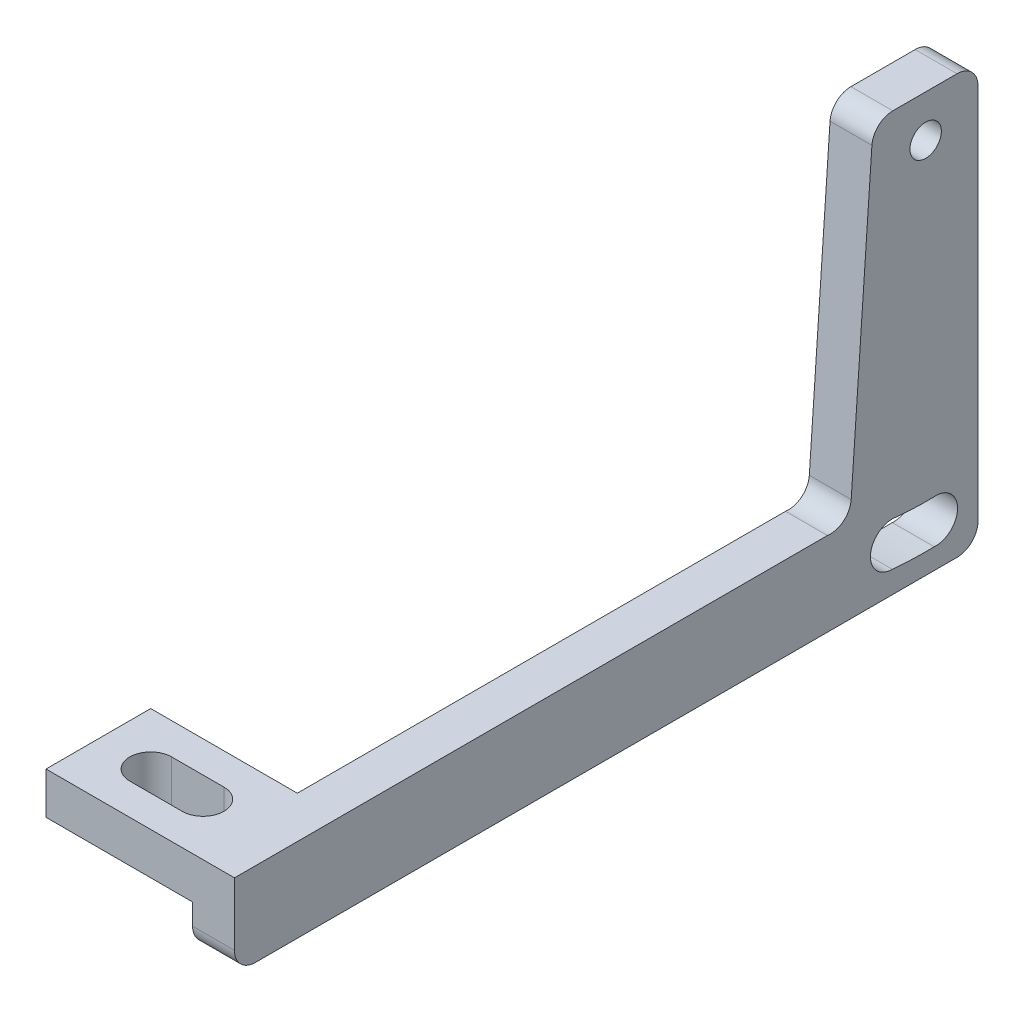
from build123d import *

# Parameters (mm, degrees)
SKETCH1_R          = 2.38125
EXTRUDE1_DEPTH     = 6.35
SKETCH3_W          = 15.875
SKETCH3_H          = 6.35
EXTRUDE2_DEPTH     = 22.225
CUT_EXTRUDE1_DEPTH = 119.542782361


with BuildPart() as part:
    # Sketch1 → Extrude1 (new body)
    with BuildSketch(Plane(origin=(0, 0, 0), x_dir=(0, 0, -1), z_dir=(1, 0, 0))):
        with BuildLine():
            Line((4.7625, 6.35), (-4.976764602, 6.35))
            ThreePointArc((-4.976764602, 6.35), (-7.142109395, 5.497048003), (-8.144030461, 3.396476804))
            Line((-8.144030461, 3.396476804), (-11.285412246, -41.527375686))
            ThreePointArc((-11.285412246, -41.527375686), (-12.454585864, -43.773337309), (-14.894552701, -44.45))
            Line((-14.894552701, -44.45), (-88.9, -44.45))
            Line((-88.9, -44.45), (-104.775, -44.45))
            Line((-104.775, -44.45), (-104.775, -53.975))
            ThreePointArc((-104.775, -53.975), (-103.84506403, -56.22006403), (-101.6, -57.15))
            Line((-101.6, -57.15), (4.7625, -57.15))
            ThreePointArc((4.7625, -57.15), (7.00756403, -56.22006403), (7.9375, -53.975))
            Line((7.9375, -53.975), (7.9375, 3.175))
            ThreePointArc((7.9375, 3.175), (7.00756403, 5.42006403), (4.7625, 6.35))
        make_face()
        with BuildLine():
            ThreePointArc((-5.06540097, -47.195196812), (-4.735829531, -47.211685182), (-4.40954949, -47.260985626))
            ThreePointArc((-4.40954949, -47.260985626), (-1.648104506, -47.437628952), (1.11894142, -47.453059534))
            ThreePointArc((1.11894142, -47.453059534), (1.434697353, -47.4283111), (1.751371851, -47.433928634))
            ThreePointArc((1.751371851, -47.433928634), (4.828468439, -50.959488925), (1.290000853, -54.021734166))
            ThreePointArc((1.290000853, -54.021734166), (-1.890976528, -54.004037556), (-5.06540097, -53.799196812))
            ThreePointArc((-5.06540097, -53.799196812), (-8.36740097, -50.497196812), (-5.06540097, -47.195196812))
        make_face(mode=Mode.SUBTRACT)
        Circle(SKETCH1_R, mode=Mode.SUBTRACT)
    extrude(amount=EXTRUDE1_DEPTH)

    # Sketch3 → Extrude2 (add)
    with BuildSketch(Plane.ZY):
        with Locations((96.8375, -47.625)):
            Rectangle(SKETCH3_W, SKETCH3_H)
    extrude(amount=EXTRUDE2_DEPTH)

    # Sketch4 → Cut-Extrude1 (cut, through all)
    with BuildSketch(Plane(origin=(0, -44.45, 0), x_dir=(-1, 0, 0), z_dir=(0, 1, 0))):
        with BuildLine():
            Line((6.35, 100.0125), (14.2875, 100.0125))
            ThreePointArc((14.2875, 100.0125), (17.4625, 96.8375), (14.2875, 93.6625))
            Line((14.2875, 93.6625), (6.35, 93.6625))
            ThreePointArc((6.35, 93.6625), (3.175, 96.8375), (6.35, 100.0125))
        make_face()
    extrude(amount=-CUT_EXTRUDE1_DEPTH, mode=Mode.SUBTRACT)


solid = part.part
